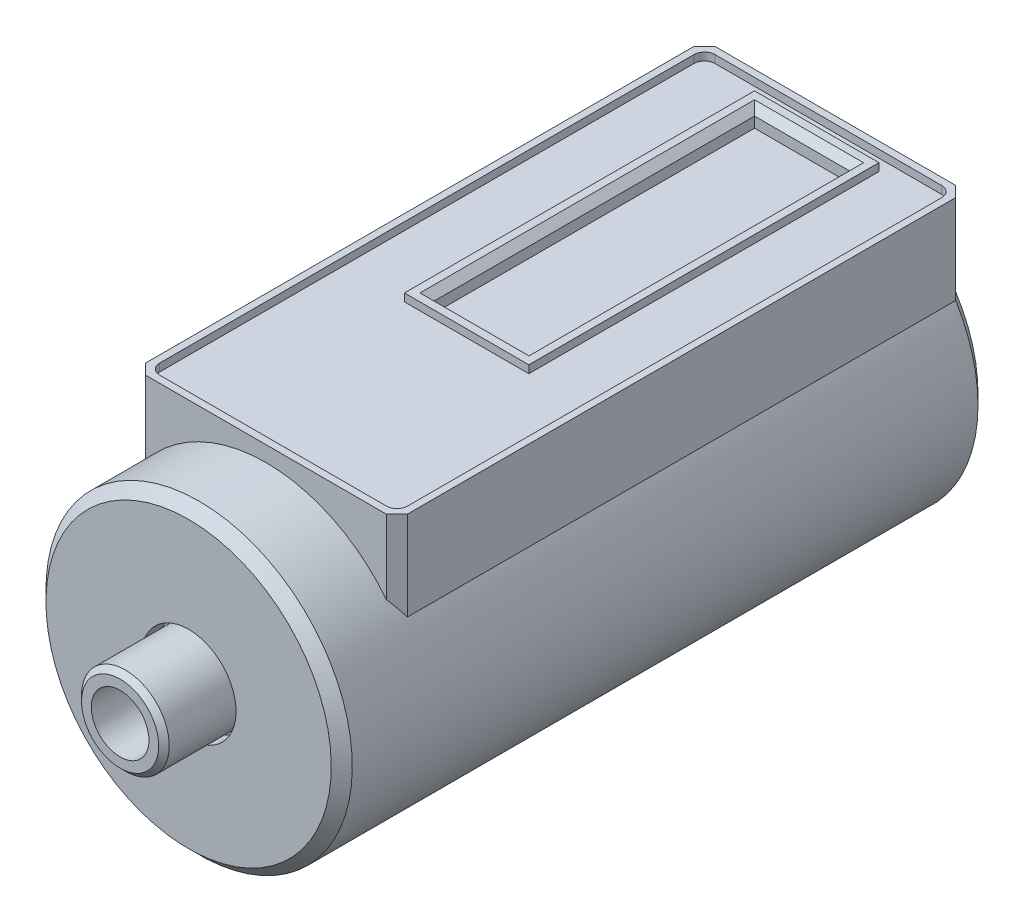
from build123d import *

# Parameters (mm, degrees)
EXTRUDE1_DEPTH     = 12.19
CHAMFER1_SIZE      = 0.76
SKETCH4_W          = 8.99
SKETCH4_H          = 25.3
CUT_EXTRUDE1_DEPTH = 0.56
SKETCH5_W          = 6.86
SKETCH5_H          = 23.16
CUT_EXTRUDE2_DEPTH = 1.27
CHAMFER2_SIZE      = 0.51
HOLE1_D            = 4.1656
HOLE1_DEPTH        = 6.35
HOLE1_TIP          = 1.251472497


with BuildPart() as part:
    # Sketch2 → Revolve1 (revolve)
    with BuildSketch(Plane(origin=(0, 0, 0), x_dir=(0, 0, -1), z_dir=(1, 0, 0))):
        Polygon((59.435, 0), (59.435, 2.79), (59.815, 3.17), (65.655, 3.17), (65.655, 3.43), (64.385, 3.43), (64.385, 10.31), (65.145, 11.07), (111.125, 11.07), (111.125, 0), align=None)
    revolve(axis=Axis((0, 0, -111.125), (0, 0, 1)))

    # Sketch3 → Extrude1 (add)
    with BuildSketch(Plane(origin=(0, 0, 0), x_dir=(1, 0, 0), z_dir=(0, 1, 0))):
        Polygon((-9.46, 111.125), (9.46, 111.125), (9.46, 70.735), (8.7, 69.975), (-8.7, 69.975), (-9.46, 70.735), align=None)
    extrude(amount=EXTRUDE1_DEPTH)

    # Chamfer1
    chamfer1_edges = [part.edges().sort_by_distance(p)[0] for p in [
        (0, -11.07, -111.125),
        (-9.46, 8.969599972, -111.125),
        (9.46, 8.969599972, -111.125),
    ]]
    chamfer(chamfer1_edges, length=CHAMFER1_SIZE)

    # Sketch4 → Cut-Extrude1 (cut)
    with BuildSketch(Plane(origin=(0, 12.19, 0), x_dir=(1, 0, 0), z_dir=(0, 1, 0))):
        with BuildLine():
            Line((-8.19, 110.615), (8.2, 110.615))
            ThreePointArc((8.2, 110.615), (8.737401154, 110.392401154), (8.96, 109.855))
            Line((8.96, 109.855), (8.96, 71.245))
            ThreePointArc((8.96, 71.245), (8.737401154, 70.707598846), (8.2, 70.485))
            Line((8.2, 70.485), (-8.19, 70.485))
            ThreePointArc((-8.19, 70.485), (-8.727401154, 70.707598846), (-8.95, 71.245))
            Line((-8.95, 71.245), (-8.95, 109.855))
            ThreePointArc((-8.95, 109.855), (-8.727401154, 110.392401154), (-8.19, 110.615))
        make_face()
        with Locations((0.005, 97.125)):
            Rectangle(SKETCH4_W, SKETCH4_H, mode=Mode.SUBTRACT)
    extrude(amount=-CUT_EXTRUDE1_DEPTH, mode=Mode.SUBTRACT)

    # Sketch5 → Cut-Extrude2 (cut)
    with BuildSketch(Plane(origin=(0, 12.19, 0), x_dir=(1, 0, 0), z_dir=(0, 1, 0))):
        with Locations((0.01, 97.125)):
            Rectangle(SKETCH5_W, SKETCH5_H)
    extrude(amount=-CUT_EXTRUDE2_DEPTH, mode=Mode.SUBTRACT)

    # Chamfer2
    chamfer2_edges = [part.edges().sort_by_distance(p)[0] for p in [
        (-3.42, 12.19, -97.125),
        (0.01, 12.19, -85.545),
        (3.44, 12.19, -97.125),
        (0.01, 12.19, -108.705),
    ]]
    chamfer(chamfer2_edges, length=CHAMFER2_SIZE)

    # Hole1
    with Locations(Plane.XY.offset(-59.435)):
        with Locations((0, 0)):
            Hole(HOLE1_D / 2, depth=HOLE1_DEPTH)
            with Locations((0, 0, -(HOLE1_DEPTH + HOLE1_TIP / 2))):  # 118° drill point
                Cone(0, HOLE1_D / 2, HOLE1_TIP, mode=Mode.SUBTRACT)


solid = part.part
